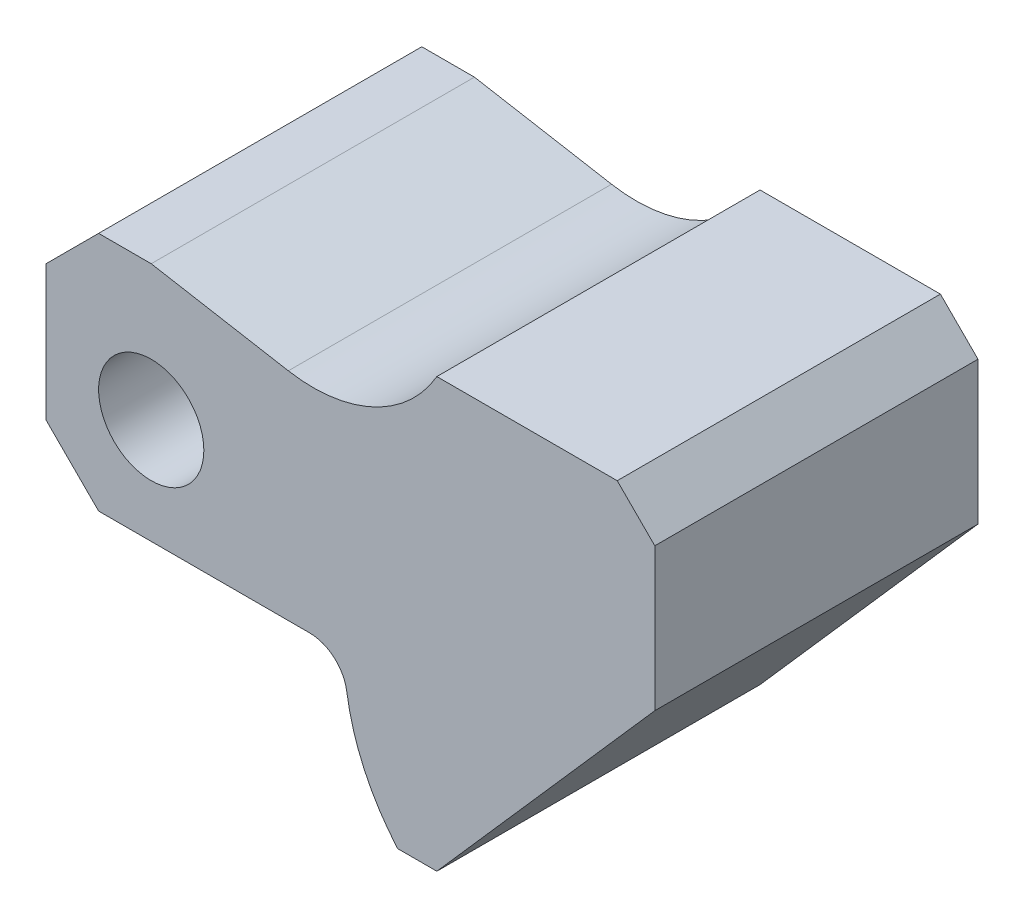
from build123d import *

# Parameters (mm, degrees)
SKETCH1_R           = 7
BOSS_EXTRUDE1_DEPTH = 43


with BuildPart() as part:
    # Sketch1 → Boss-Extrude1 (new body)
    with BuildSketch(Plane.XY):
        with BuildLine():
            Line((-14, -7), (-14, 11))
            Line((-14, 11), (-7, 18))
            Line((-7, 18), (0, 18))
            Line((0, 18), (18.243084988, 14.783251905))
            ThreePointArc((18.243084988, 14.783251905), (29.574972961, 16.276069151), (38, 24))
            Line((38, 24), (62, 24))
            Line((62, 24), (67, 19))
            Line((67, 19), (67, 0))
            Line((67, 0), (38, -33))
            Line((38, -33), (32.788067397, -33))
            ThreePointArc((32.788067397, -33), (28.3490952, -26.115672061), (26.012264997, -18.264705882))
            ThreePointArc((26.012264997, -18.264705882), (24.331862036, -15.213413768), (21.066626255, -14))
            Line((21.066626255, -14), (-7, -14))
            Line((-7, -14), (-14, -7))
        make_face()
        Circle(SKETCH1_R, mode=Mode.SUBTRACT)
    extrude(amount=BOSS_EXTRUDE1_DEPTH)


solid = part.part
